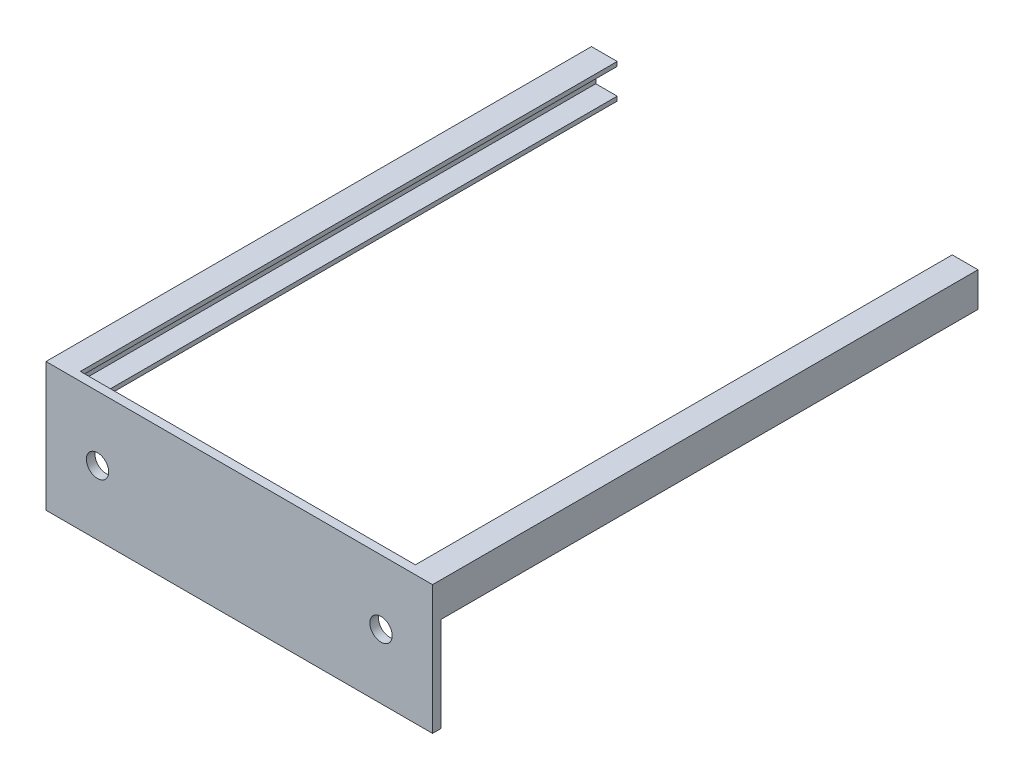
from build123d import *

# Parameters (mm, degrees)
ESTRUSIONE_ESTRUSIONE1_DEPTH = 125
SCHIZZO2_W                   = 90
SCHIZZO2_H                   = 30
ESTRUSIONE_ESTRUSIONE2_DEPTH = 2
SCHIZZO3_W                   = 2.6
SCHIZZO3_H                   = 2
FORO_5_2_5_2_1_AT_2_COUNT    = 2
FORO_5_2_5_2_1_AT_2_PITCH    = 58.77773278
FORO_5_2_5_2_1_AT_3_COUNT    = 2
FORO_5_2_5_2_1_AT_3_PITCH    = 57.738507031
FORO_5_2_5_2_1_AT_4_COUNT    = 2
FORO_5_2_5_2_1_AT_4_PITCH    = 59.726893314
SPECCHIA1_COPY_1_SKETCH_W    = 2.6
SPECCHIA1_COPY_1_SKETCH_H    = 2
SPECCHIA1_COPY_2_SKETCH_W    = 2.6
SPECCHIA1_COPY_2_SKETCH_H    = 2
SPECCHIA1_COPY_3_SKETCH_W    = 2.6
SPECCHIA1_COPY_3_SKETCH_H    = 2


with BuildPart() as part:
    # Schizzo1 → Estrusione-Estrusione1 (new body)
    with BuildSketch(Plane.XY):
        Polygon((0, 0), (-6, 0), (-6, 8), (0, 8), (0, 7), (-5, 7), (-5, 1), (0, 1), align=None)
    estrusione_estrusione1 = extrude(amount=ESTRUSIONE_ESTRUSIONE1_DEPTH)

    # Schizzo2 → Estrusione-Estrusione2 (add)
    with BuildSketch(Plane.XY.offset(125)):
        with Locations((39, -7)):
            Rectangle(SCHIZZO2_W, SCHIZZO2_H)
    extrude(amount=ESTRUSIONE_ESTRUSIONE2_DEPTH)

    # Schizzo3 → Foro _5.2 _5.2_-1 (revolve, cut)
    with BuildSketch(Plane(origin=(6, -7, 127), x_dir=(0, -1, 0), z_dir=(1, 0, 0))):
        with Locations((1.3, 1)):
            Rectangle(SCHIZZO3_W, SCHIZZO3_H)
    foro_5_2_5_2_1 = revolve(axis=Axis((6, -7, 133.35), (0, 0, -1)), mode=Mode.SUBTRACT)

    # Foro _5.2 _5.2_-1 at 2: Foro _5.2 _5.2_-1 ×2
    with Locations(*[Vector(-0.30411350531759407, -0.9526358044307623, 0) * (i * FORO_5_2_5_2_1_AT_2_PITCH) for i in range(1, FORO_5_2_5_2_1_AT_2_COUNT)]):
        add(foro_5_2_5_2_1, mode=Mode.SUBTRACT)

    # Foro _5.2 _5.2_-1 at 3: Foro _5.2 _5.2_-1 ×2
    with Locations(*[Vector(-0.29527757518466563, -0.9554115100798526, 0) * (i * FORO_5_2_5_2_1_AT_3_PITCH) for i in range(1, FORO_5_2_5_2_1_AT_3_COUNT)]):
        add(foro_5_2_5_2_1, mode=Mode.SUBTRACT)

    # Foro _5.2 _5.2_-1 at 4: Foro _5.2 _5.2_-1 ×2
    with Locations(*[Vector(-0.4426179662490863, -0.8967102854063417, 0) * (i * FORO_5_2_5_2_1_AT_4_PITCH) for i in range(1, FORO_5_2_5_2_1_AT_4_COUNT)]):
        add(foro_5_2_5_2_1, mode=Mode.SUBTRACT)

    # Specchia1: Estrusione-Estrusione1, Foro _5.2 _5.2_-1 across plane
    add(estrusione_estrusione1.mirror(Plane(origin=(39, 0, 0), x_dir=(0, 0, 1), z_dir=(1, 0, 0))))
    add(foro_5_2_5_2_1.mirror(Plane(origin=(39, 0, 0), x_dir=(0, 0, 1), z_dir=(1, 0, 0))), mode=Mode.SUBTRACT)

    # Specchia1 copy 1 sketch → Specchia1 copy 1 (revolve, cut)
    with BuildSketch(Plane(origin=(89.87510235, -62.99377275, 127), x_dir=(0, -1, 0), z_dir=(-1, 0, 0))):
        with Locations((1.3, -1)):
            Rectangle(SPECCHIA1_COPY_1_SKETCH_W, SPECCHIA1_COPY_1_SKETCH_H)
    revolve(axis=Axis((89.87510235, -62.99377275, 133.35), (0, 0, 1)), mode=Mode.SUBTRACT)

    # Specchia1 copy 2 sketch → Specchia1 copy 2 (revolve, cut)
    with BuildSketch(Plane(origin=(89.048886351, -62.164034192, 127), x_dir=(0, -1, 0), z_dir=(-1, 0, 0))):
        with Locations((1.3, -1)):
            Rectangle(SPECCHIA1_COPY_2_SKETCH_W, SPECCHIA1_COPY_2_SKETCH_H)
    revolve(axis=Axis((89.048886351, -62.164034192, 133.35), (0, 0, 1)), mode=Mode.SUBTRACT)

    # Specchia1 copy 3 sketch → Specchia1 copy 3 (revolve, cut)
    with BuildSketch(Plane(origin=(98.436196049, -60.55771955, 127), x_dir=(0, -1, 0), z_dir=(-1, 0, 0))):
        with Locations((1.3, -1)):
            Rectangle(SPECCHIA1_COPY_3_SKETCH_W, SPECCHIA1_COPY_3_SKETCH_H)
    revolve(axis=Axis((98.436196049, -60.55771955, 133.35), (0, 0, 1)), mode=Mode.SUBTRACT)


solid = part.part
